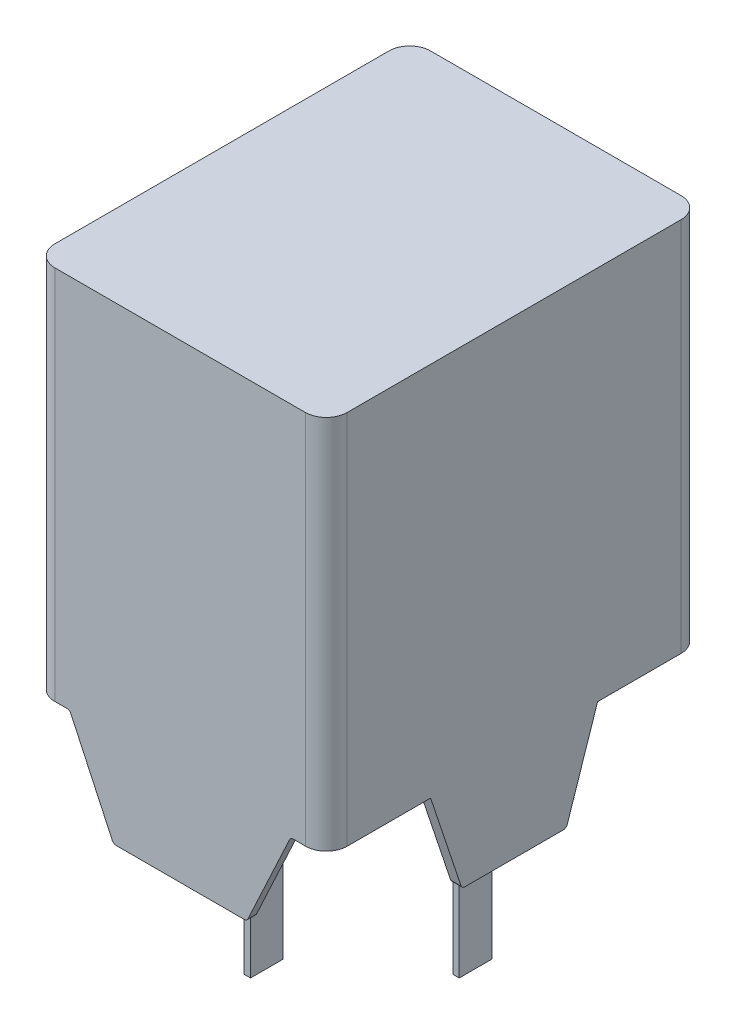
from build123d import *

# Parameters (mm, degrees)
ESQUISSE1_W             = 14
ESQUISSE1_H             = 22.5
BOSS_EXTRU_1_DEPTH      = 18
ENL_V_MAT_EXTRU_1_DEPTH = 3
ESQUISSE3_W             = 2.586581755
ESQUISSE3_H             = 4.5
ENL_V_MAT_EXTRU_2_DEPTH = 26.42759328
ENL_V_MAT_EXTRU_3_DEPTH = 26.42759328
ESQUISSE7_W             = 13
ESQUISSE7_H             = 4.5
ENL_V_MAT_EXTRU_4_DEPTH = 17.5
CONG_1_R                = 1
ESQUISSE8_W             = 0.3
ESQUISSE8_H             = 1.558975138
BOSS_EXTRU_3_DEPTH      = 10


with BuildPart() as part:
    # Esquisse1 → Boss.-Extru.1 (new body)
    with BuildSketch(Plane.XY):
        Rectangle(ESQUISSE1_W, ESQUISSE1_H)
    extrude(amount=BOSS_EXTRU_1_DEPTH)

    # Esquisse2 → Enl_v. mat.-Extru.1 (cut)
    with BuildSketch(Plane.XY.offset(18)):
        with BuildLine():
            ThreePointArc((-5.240123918, -6.854618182), (-5.314515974, -6.769964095), (-5.422866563, -6.738969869))
            Line((-5.422866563, -6.738969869), (-7, -6.75))
            Line((-7, -6.75), (-7, -11.25))
            Line((-7, -11.25), (-3.068190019, -11.25))
            ThreePointArc((-3.068190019, -11.25), (-3.175732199, -11.218625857), (-3.249533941, -11.134346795))
            Line((-3.249533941, -11.134346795), (-5.240123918, -6.854618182))
        make_face()
        with BuildLine():
            Line((7, -11.25), (7, -6.75))
            Line((7, -6.75), (5.422866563, -6.738969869))
            ThreePointArc((5.422866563, -6.738969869), (5.314515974, -6.769964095), (5.240123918, -6.854618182))
            Line((5.240123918, -6.854618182), (3.249533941, -11.134346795))
            ThreePointArc((3.249533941, -11.134346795), (3.175732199, -11.218625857), (3.068190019, -11.25))
            Line((3.068190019, -11.25), (7, -11.25))
        make_face()
    extrude(amount=-ENL_V_MAT_EXTRU_1_DEPTH, mode=Mode.SUBTRACT)

    # Esquisse3 → Enl_v. mat.-Extru.2 (cut, through all)
    with BuildSketch(Plane.ZY.offset(7)):
        with Locations((16.293290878, -9)):
            Rectangle(ESQUISSE3_W, ESQUISSE3_H)
    extrude(amount=-ENL_V_MAT_EXTRU_2_DEPTH, mode=Mode.SUBTRACT)

    # Esquisse5 → Enl_v. mat.-Extru.3 (cut, through all)
    with BuildSketch(Plane.ZY.offset(7)):
        with BuildLine():
            Line((6.454415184, -11.113245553), (5, -6.75))
            Line((5, -6.75), (0, -6.75))
            Line((0, -6.75), (0, -11.25))
            Line((0, -11.25), (6.644151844, -11.25))
            ThreePointArc((6.644151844, -11.25), (6.527209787, -11.212248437), (6.454415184, -11.113245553))
        make_face()
        with BuildLine():
            Line((15, -11.25), (15, -6.75))
            Line((15, -6.75), (13, -6.75))
            Line((13, -6.75), (11.545584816, -11.113245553))
            ThreePointArc((11.545584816, -11.113245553), (11.472790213, -11.212248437), (11.355848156, -11.25))
            Line((11.355848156, -11.25), (15, -11.25))
        make_face()
    extrude(amount=-ENL_V_MAT_EXTRU_3_DEPTH, mode=Mode.SUBTRACT)

    # Esquisse7 → Enl_v. mat.-Extru.4 (cut)
    with BuildSketch(Plane(origin=(0, 0, 0), x_dir=(-1, 0, 0), z_dir=(0, 0, -1))):
        with Locations((0, -9)):
            Rectangle(ESQUISSE7_W, ESQUISSE7_H)
    extrude(amount=-ENL_V_MAT_EXTRU_4_DEPTH, mode=Mode.SUBTRACT)

    # Cong_1
    cong_1_edges = [part.edges().sort_by_distance(p)[0] for p in [
        (-7, 2.25, 18),
        (7, 2.25, 18),
        (-7, 2.25, 0),
        (7, 2.25, 0),
    ]]
    fillet(cong_1_edges, radius=CONG_1_R)

    # Esquisse8 → Boss.-Extru.3 (add)
    with BuildSketch(Plane.XZ.offset(6.75)):
        with Locations((0, 14)):
            Rectangle(ESQUISSE8_W, ESQUISSE8_H)
        with Locations((-5, 9)):
            Rectangle(ESQUISSE8_W, ESQUISSE8_H)
        with Locations((5, 9)):
            Rectangle(ESQUISSE8_W, ESQUISSE8_H)
    extrude(amount=BOSS_EXTRU_3_DEPTH)


solid = part.part
